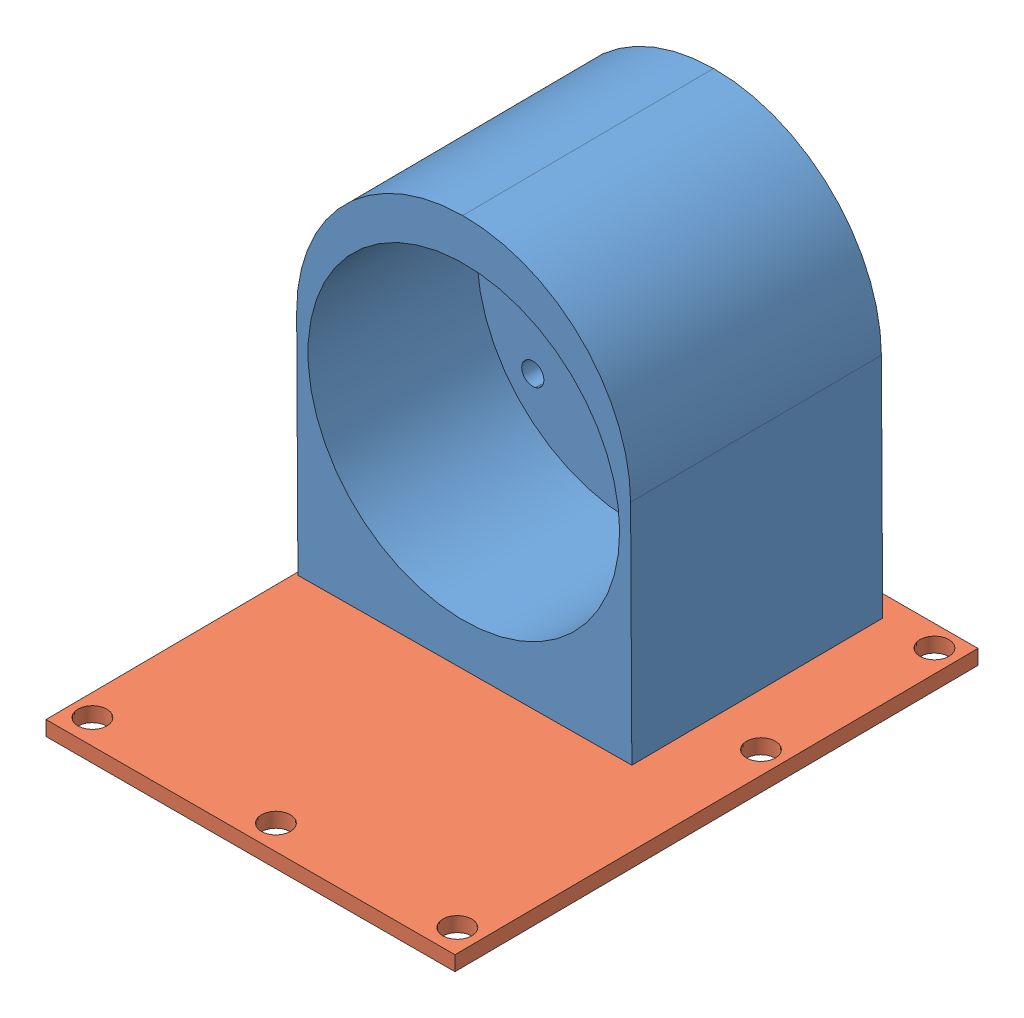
SolidWorks assembly 固定架.SLDASM, configuration 默认 (file format 10000). Lengths in mm.
Overall size (55.47 56.12 71.44).
2 component instances, 2 part files, 0 mates.
Components (placement in the parent):
- 零件-1: 零件.SLDPRT [默认] at (-12.9601 -19.9035 -23.1301) x (0.999984 0.002671 -0.004894) z (0.004902 -0.002842 0.999984) size (45 53.34 34.13)
- 零件1-1: 零件1.SLDPRT [默认] at (-7.8438 -20.4486 -16.435) x (-0.004759 0.002426 -0.999986) z (0.999985 -0.002832 -0.004766) size (71.17 2 55.12)
